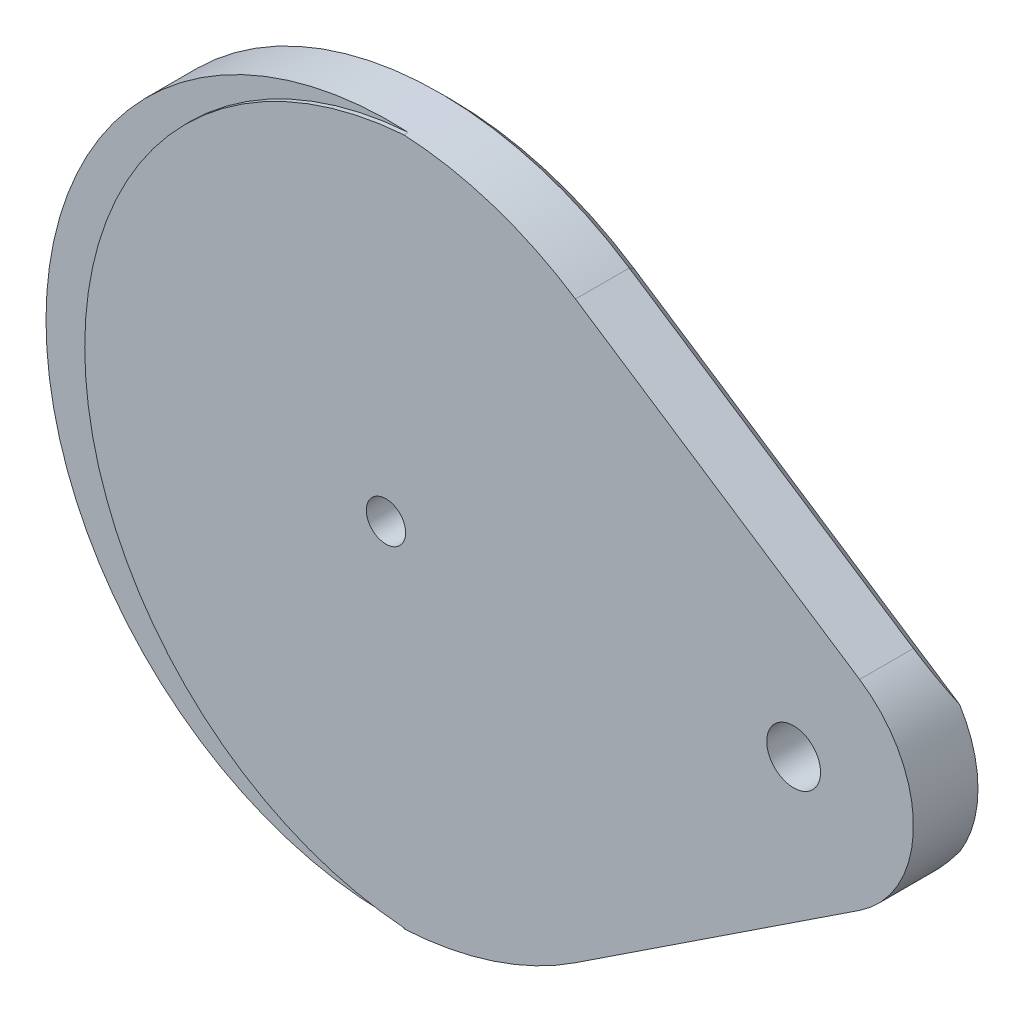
ISO-10303-21;
HEADER;
FILE_DESCRIPTION(('STEP AP214'),'2;1');
FILE_NAME('part.step','',(''),(''),'','','');
FILE_SCHEMA(('AUTOMOTIVE_DESIGN { 1 0 10303 214 1 1 1 1 }'));
ENDSEC;
DATA;
#1=APPLICATION_CONTEXT('core data for automotive mechanical design processes');
#2=APPLICATION_PROTOCOL_DEFINITION('international standard','automotive_design',2000,#1);
#3=PRODUCT_CONTEXT('',#1,'mechanical');
#4=PRODUCT('Part','Part','',(#3));
#5=PRODUCT_RELATED_PRODUCT_CATEGORY('part','',(#4));
#6=PRODUCT_DEFINITION_FORMATION('','',#4);
#7=PRODUCT_DEFINITION_CONTEXT('part definition',#1,'design');
#8=PRODUCT_DEFINITION('design','',#6,#7);
#9=PRODUCT_DEFINITION_SHAPE('','',#8);
#10=(LENGTH_UNIT() NAMED_UNIT(*) SI_UNIT(.MILLI.,.METRE.));
#11=(NAMED_UNIT(*) PLANE_ANGLE_UNIT() SI_UNIT($,.RADIAN.));
#12=(NAMED_UNIT(*) SI_UNIT($,.STERADIAN.) SOLID_ANGLE_UNIT());
#13=UNCERTAINTY_MEASURE_WITH_UNIT(LENGTH_MEASURE(1.E-05),#10,'distance_accuracy_value','');
#14=(GEOMETRIC_REPRESENTATION_CONTEXT(3) GLOBAL_UNCERTAINTY_ASSIGNED_CONTEXT((#13)) GLOBAL_UNIT_ASSIGNED_CONTEXT((#10,
#11,#12)) REPRESENTATION_CONTEXT('',''));
#15=CARTESIAN_POINT('',(0.,0.,0.));
#16=DIRECTION('',(0.,0.,1.));
#17=DIRECTION('',(1.,0.,0.));
#18=AXIS2_PLACEMENT_3D('',#15,#16,#17);
#19=CARTESIAN_POINT('',(0.,0.,0.));
#20=DIRECTION('',(0.,0.,1.));
#21=DIRECTION('',(1.,0.,0.));
#22=AXIS2_PLACEMENT_3D('',#19,#20,#21);
#23=PLANE('',#22);
#24=CARTESIAN_POINT('',(0.,0.,0.));
#25=DIRECTION('',(0.,0.,1.));
#26=DIRECTION('',(1.,0.,0.));
#27=AXIS2_PLACEMENT_3D('',#24,#25,#26);
#28=CIRCLE('',#27,5.79896140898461);
#29=CARTESIAN_POINT('',(-5.79896140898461,0.,0.));
#30=VERTEX_POINT('',#29);
#31=EDGE_CURVE('E217',#30,#30,#28,.T.);
#32=ORIENTED_EDGE('',*,*,#31,.T.);
#33=EDGE_LOOP('',(#32));
#34=FACE_BOUND('',#33,.T.);
#35=DIRECTION('',(0.834795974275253,0.550559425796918,0.));
#36=VECTOR('',#35,1.);
#37=CARTESIAN_POINT('',(54.1888114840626,-82.1647937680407,0.));
#38=LINE('',#37,#36);
#39=CARTESIAN_POINT('',(54.1888114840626,-82.1647937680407,0.));
#40=VERTEX_POINT('',#39);
#41=CARTESIAN_POINT('',(150.262212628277,-18.8030644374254,0.));
#42=VERTEX_POINT('',#41);
#43=EDGE_CURVE('E175',#40,#42,#38,.T.);
#44=ORIENTED_EDGE('',*,*,#43,.F.);
#45=CARTESIAN_POINT('',(0.,0.,0.));
#46=DIRECTION('',(0.,0.,1.));
#47=DIRECTION('',(1.,0.,0.));
#48=AXIS2_PLACEMENT_3D('',#45,#46,#47);
#49=CIRCLE('',#48,98.4249999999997);
#50=CARTESIAN_POINT('',(54.1888114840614,82.1647937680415,0.));
#51=VERTEX_POINT('',#50);
#52=EDGE_CURVE('E169',#51,#40,#49,.T.);
#53=ORIENTED_EDGE('',*,*,#52,.F.);
#54=DIRECTION('',(0.834795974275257,-0.550559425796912,0.));
#55=VECTOR('',#54,1.);
#56=CARTESIAN_POINT('',(165.35578994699,8.84864261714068,0.));
#57=LINE('',#56,#55);
#58=CARTESIAN_POINT('',(150.262212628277,18.8030644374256,0.));
#59=VERTEX_POINT('',#58);
#60=EDGE_CURVE('E155',#51,#59,#57,.T.);
#61=ORIENTED_EDGE('',*,*,#60,.T.);
#62=CARTESIAN_POINT('',(120.3198,0.,0.));
#63=DIRECTION('',(0.,0.,1.));
#64=DIRECTION('',(1.,0.,0.));
#65=AXIS2_PLACEMENT_3D('',#62,#63,#64);
#66=CIRCLE('',#65,35.3568);
#67=EDGE_CURVE('E223',#42,#59,#66,.T.);
#68=ORIENTED_EDGE('',*,*,#67,.F.);
#69=EDGE_LOOP('',(#44,#53,#61,#68));
#70=FACE_BOUND('',#69,.T.);
#71=DIRECTION('',(0.,1.,0.));
#72=VECTOR('',#71,1.);
#73=CARTESIAN_POINT('',(123.4948,-22.225,0.));
#74=LINE('',#73,#72);
#75=CARTESIAN_POINT('',(123.4948,19.05,0.));
#76=VERTEX_POINT('',#75);
#77=CARTESIAN_POINT('',(123.4948,7.27483891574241,0.));
#78=VERTEX_POINT('',#77);
#79=EDGE_CURVE('E54',#76,#78,#74,.F.);
#80=ORIENTED_EDGE('',*,*,#79,.F.);
#81=CARTESIAN_POINT('',(120.3198,19.05,0.));
#82=DIRECTION('',(0.,0.,1.));
#83=DIRECTION('',(1.,0.,0.));
#84=AXIS2_PLACEMENT_3D('',#81,#82,#83);
#85=CIRCLE('',#84,3.175);
#86=CARTESIAN_POINT('',(117.1448,19.05,0.));
#87=VERTEX_POINT('',#86);
#88=EDGE_CURVE('E11',#76,#87,#85,.T.);
#89=ORIENTED_EDGE('',*,*,#88,.T.);
#90=DIRECTION('',(0.,1.,0.));
#91=VECTOR('',#90,1.);
#92=CARTESIAN_POINT('',(117.1448,-22.225,0.));
#93=LINE('',#92,#91);
#94=CARTESIAN_POINT('',(117.1448,7.27483891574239,0.));
#95=VERTEX_POINT('',#94);
#96=EDGE_CURVE('E144',#95,#87,#93,.T.);
#97=ORIENTED_EDGE('',*,*,#96,.F.);
#98=CARTESIAN_POINT('',(120.3198,0.,0.));
#99=DIRECTION('',(0.,0.,1.));
#100=DIRECTION('',(1.,0.,0.));
#101=AXIS2_PLACEMENT_3D('',#98,#99,#100);
#102=CIRCLE('',#101,7.93750000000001);
#103=CARTESIAN_POINT('',(117.1448,-7.27483891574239,0.));
#104=VERTEX_POINT('',#103);
#105=EDGE_CURVE('E213',#95,#104,#102,.T.);
#106=ORIENTED_EDGE('',*,*,#105,.T.);
#107=CARTESIAN_POINT('',(117.1448,-19.05,0.));
#108=VERTEX_POINT('',#107);
#109=EDGE_CURVE('E46',#108,#104,#93,.T.);
#110=ORIENTED_EDGE('',*,*,#109,.F.);
#111=CARTESIAN_POINT('',(120.3198,-19.05,0.));
#112=DIRECTION('',(0.,0.,1.));
#113=DIRECTION('',(1.,0.,0.));
#114=AXIS2_PLACEMENT_3D('',#111,#112,#113);
#115=CIRCLE('',#114,3.175);
#116=CARTESIAN_POINT('',(123.4948,-19.05,0.));
#117=VERTEX_POINT('',#116);
#118=EDGE_CURVE('E39',#108,#117,#115,.T.);
#119=ORIENTED_EDGE('',*,*,#118,.T.);
#120=CARTESIAN_POINT('',(123.4948,-7.27483891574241,0.));
#121=VERTEX_POINT('',#120);
#122=EDGE_CURVE('E152',#121,#117,#74,.F.);
#123=ORIENTED_EDGE('',*,*,#122,.F.);
#124=EDGE_CURVE('E150',#121,#78,#102,.T.);
#125=ORIENTED_EDGE('',*,*,#124,.T.);
#126=EDGE_LOOP('',(#80,#89,#97,#106,#110,#119,#123,#125));
#127=FACE_BOUND('',#126,.T.);
#128=ADVANCED_FACE('F31',(#34,#70,#127),#23,.F.);
#129=CARTESIAN_POINT('',(120.3198,0.,19.05));
#130=DIRECTION('',(0.,0.,-1.));
#131=DIRECTION('',(-1.,0.,0.));
#132=AXIS2_PLACEMENT_3D('',#129,#130,#131);
#133=CYLINDRICAL_SURFACE('',#132,7.93750000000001);
#134=CARTESIAN_POINT('',(120.3198,0.,19.05));
#135=DIRECTION('',(0.,0.,1.));
#136=DIRECTION('',(1.,0.,0.));
#137=AXIS2_PLACEMENT_3D('',#134,#135,#136);
#138=CIRCLE('',#137,7.93750000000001);
#139=CARTESIAN_POINT('',(128.2573,0.,19.05));
#140=VERTEX_POINT('',#139);
#141=EDGE_CURVE('E214',#140,#140,#138,.T.);
#142=ORIENTED_EDGE('',*,*,#141,.T.);
#143=EDGE_LOOP('',(#142));
#144=FACE_BOUND('',#143,.T.);
#145=ORIENTED_EDGE('',*,*,#124,.F.);
#146=CARTESIAN_POINT('',(123.4948,-7.27483891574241,0.));
#147=CARTESIAN_POINT('',(123.494812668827,-7.27482137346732,0.0854167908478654));
#148=CARTESIAN_POINT('',(123.491353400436,-7.27634285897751,0.170823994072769));
#149=CARTESIAN_POINT('',(123.477590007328,-7.28233280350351,0.340949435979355));
#150=CARTESIAN_POINT('',(123.467288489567,-7.28680014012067,0.425667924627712));
#151=CARTESIAN_POINT('',(123.439993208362,-7.29852780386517,0.593481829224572));
#152=CARTESIAN_POINT('',(123.423025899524,-7.30577708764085,0.676582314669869));
#153=CARTESIAN_POINT('',(123.382589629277,-7.32282084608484,0.840899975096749));
#154=CARTESIAN_POINT('',(123.359120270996,-7.33261547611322,0.922117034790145));
#155=CARTESIAN_POINT('',(123.279328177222,-7.36535374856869,1.16194816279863));
#156=CARTESIAN_POINT('',(123.213566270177,-7.39167700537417,1.31707609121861));
#157=CARTESIAN_POINT('',(123.059002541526,-7.45033388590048,1.61416298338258));
#158=CARTESIAN_POINT('',(122.97017881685,-7.48267321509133,1.75610925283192));
#159=CARTESIAN_POINT('',(122.766642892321,-7.55175336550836,2.03082905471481));
#160=CARTESIAN_POINT('',(122.65083600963,-7.58863489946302,2.16275795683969));
#161=CARTESIAN_POINT('',(122.398943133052,-7.66147804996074,2.40592018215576));
#162=CARTESIAN_POINT('',(122.262852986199,-7.6974394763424,2.51714925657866));
#163=CARTESIAN_POINT('',(121.967634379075,-7.76610424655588,2.72003265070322));
#164=CARTESIAN_POINT('',(121.807808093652,-7.79862271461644,2.81073988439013));
#165=CARTESIAN_POINT('',(121.473633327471,-7.85501261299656,2.96361496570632));
#166=CARTESIAN_POINT('',(121.299290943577,-7.87888765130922,3.02579472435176));
#167=CARTESIAN_POINT('',(120.949985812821,-7.91429574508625,3.11680415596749));
#168=CARTESIAN_POINT('',(120.775461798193,-7.92637039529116,3.14710278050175));
#169=CARTESIAN_POINT('',(120.423413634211,-7.93877492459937,3.17822021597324));
#170=CARTESIAN_POINT('',(120.245890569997,-7.93910896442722,3.17904947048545));
#171=CARTESIAN_POINT('',(119.90350451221,-7.9283236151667,3.15200847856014));
#172=CARTESIAN_POINT('',(119.738490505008,-7.91784651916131,3.12574768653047));
#173=CARTESIAN_POINT('',(119.415441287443,-7.88748217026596,3.04801048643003));
#174=CARTESIAN_POINT('',(119.257406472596,-7.86759438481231,2.99653265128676));
#175=CARTESIAN_POINT('',(118.949950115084,-7.81997467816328,2.86918968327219));
#176=CARTESIAN_POINT('',(118.800694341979,-7.7921290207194,2.7929685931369));
#177=CARTESIAN_POINT('',(118.51670579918,-7.73135683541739,2.61863820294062));
#178=CARTESIAN_POINT('',(118.381978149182,-7.69842852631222,2.52052122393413));
#179=CARTESIAN_POINT('',(118.121487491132,-7.62828318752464,2.29767442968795));
#180=CARTESIAN_POINT('',(117.996891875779,-7.59092651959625,2.17162128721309));
#181=CARTESIAN_POINT('',(117.770119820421,-7.51779639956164,1.90028038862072));
#182=CARTESIAN_POINT('',(117.667953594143,-7.48202367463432,1.75498391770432));
#183=CARTESIAN_POINT('',(117.486203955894,-7.41514238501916,1.44383497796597));
#184=CARTESIAN_POINT('',(117.407354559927,-7.3841975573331,1.27751148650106));
#185=CARTESIAN_POINT('',(117.311344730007,-7.34535742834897,1.01897061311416));
#186=CARTESIAN_POINT('',(117.28305640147,-7.33367552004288,0.931303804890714));
#187=CARTESIAN_POINT('',(117.234141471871,-7.31322917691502,0.753538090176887));
#188=CARTESIAN_POINT('',(117.213511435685,-7.3044634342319,0.66344029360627));
#189=CARTESIAN_POINT('',(117.179569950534,-7.28994070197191,0.478275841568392));
#190=CARTESIAN_POINT('',(117.166547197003,-7.28430276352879,0.38314681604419));
#191=CARTESIAN_POINT('',(117.149154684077,-7.27673901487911,0.192016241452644));
#192=CARTESIAN_POINT('',(117.144779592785,-7.27481091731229,0.096015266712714));
#193=CARTESIAN_POINT('',(117.1448,-7.27483891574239,0.));
#194=B_SPLINE_CURVE_WITH_KNOTS('',3,(#146,#147,#148,#149,#150,#151,#152,#153,#154,#155,#156,
#157,#158,#159,#160,#161,#162,#163,#164,#165,#166,#167,#168,#169,#170,#171,#172,#173,#174,#175,
#176,#177,#178,#179,#180,#181,#182,#183,#184,#185,#186,#187,#188,#189,#190,#191,#192,#193),
.UNSPECIFIED.,.F.,.F.,(4,2,2,2,2,2,2,2,2,2,2,2,2,2,2,2,2,2,2,2,2,2,2,4),(0.,0.256150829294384,
0.512204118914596,0.767251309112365,1.02231407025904,1.53143426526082,2.0410397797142,
2.57679901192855,3.11266809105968,3.66971038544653,4.22651988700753,4.75637028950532,
5.28603291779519,5.78594402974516,6.28588343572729,6.79335980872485,7.30101443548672,
7.84196226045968,8.3831559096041,8.93991483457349,9.21815697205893,9.49627415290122,
9.78435582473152,10.072259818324),.UNSPECIFIED.);
#195=EDGE_CURVE('E266',#121,#104,#194,.T.);
#196=ORIENTED_EDGE('',*,*,#195,.T.);
#197=ORIENTED_EDGE('',*,*,#105,.F.);
#198=CARTESIAN_POINT('',(117.1448,7.27483891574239,0.));
#199=CARTESIAN_POINT('',(117.144787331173,7.27482137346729,0.0854167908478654));
#200=CARTESIAN_POINT('',(117.148246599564,7.27634285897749,0.17082399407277));
#201=CARTESIAN_POINT('',(117.162009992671,7.28233280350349,0.340949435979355));
#202=CARTESIAN_POINT('',(117.172311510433,7.28680014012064,0.425667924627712));
#203=CARTESIAN_POINT('',(117.199606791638,7.29852780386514,0.593481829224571));
#204=CARTESIAN_POINT('',(117.216574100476,7.30577708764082,0.676582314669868));
#205=CARTESIAN_POINT('',(117.257010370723,7.32282084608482,0.840899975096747));
#206=CARTESIAN_POINT('',(117.280479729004,7.3326154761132,0.922117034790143));
#207=CARTESIAN_POINT('',(117.360271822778,7.36535374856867,1.16194816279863));
#208=CARTESIAN_POINT('',(117.426033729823,7.39167700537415,1.31707609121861));
#209=CARTESIAN_POINT('',(117.580597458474,7.45033388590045,1.61416298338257));
#210=CARTESIAN_POINT('',(117.66942118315,7.48267321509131,1.75610925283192));
#211=CARTESIAN_POINT('',(117.872957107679,7.55175336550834,2.03082905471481));
#212=CARTESIAN_POINT('',(117.98876399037,7.588634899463,2.16275795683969));
#213=CARTESIAN_POINT('',(118.240656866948,7.66147804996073,2.40592018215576));
#214=CARTESIAN_POINT('',(118.376747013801,7.69743947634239,2.51714925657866));
#215=CARTESIAN_POINT('',(118.671965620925,7.76610424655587,2.72003265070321));
#216=CARTESIAN_POINT('',(118.831791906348,7.79862271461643,2.81073988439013));
#217=CARTESIAN_POINT('',(119.165966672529,7.85501261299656,2.96361496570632));
#218=CARTESIAN_POINT('',(119.340309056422,7.87888765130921,3.02579472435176));
#219=CARTESIAN_POINT('',(119.689614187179,7.91429574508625,3.11680415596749));
#220=CARTESIAN_POINT('',(119.864138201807,7.92637039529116,3.14710278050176));
#221=CARTESIAN_POINT('',(120.216186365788,7.93877492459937,3.17822021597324));
#222=CARTESIAN_POINT('',(120.393709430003,7.93910896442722,3.17904947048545));
#223=CARTESIAN_POINT('',(120.73609548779,7.9283236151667,3.15200847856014));
#224=CARTESIAN_POINT('',(120.901109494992,7.91784651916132,3.12574768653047));
#225=CARTESIAN_POINT('',(121.224158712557,7.88748217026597,3.04801048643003));
#226=CARTESIAN_POINT('',(121.382193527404,7.86759438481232,2.99653265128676));
#227=CARTESIAN_POINT('',(121.689649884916,7.81997467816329,2.86918968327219));
#228=CARTESIAN_POINT('',(121.838905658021,7.79212902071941,2.79296859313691));
#229=CARTESIAN_POINT('',(122.12289420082,7.73135683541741,2.61863820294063));
#230=CARTESIAN_POINT('',(122.257621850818,7.69842852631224,2.52052122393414));
#231=CARTESIAN_POINT('',(122.518112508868,7.62828318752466,2.29767442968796));
#232=CARTESIAN_POINT('',(122.642708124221,7.59092651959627,2.1716212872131));
#233=CARTESIAN_POINT('',(122.869480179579,7.51779639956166,1.90028038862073));
#234=CARTESIAN_POINT('',(122.971646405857,7.48202367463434,1.75498391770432));
#235=CARTESIAN_POINT('',(123.153396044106,7.41514238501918,1.44383497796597));
#236=CARTESIAN_POINT('',(123.232245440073,7.38419755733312,1.27751148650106));
#237=CARTESIAN_POINT('',(123.328255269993,7.34535742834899,1.01897061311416));
#238=CARTESIAN_POINT('',(123.35654359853,7.3336755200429,0.931303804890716));
#239=CARTESIAN_POINT('',(123.405458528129,7.31322917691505,0.753538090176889));
#240=CARTESIAN_POINT('',(123.426088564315,7.30446343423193,0.663440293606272));
#241=CARTESIAN_POINT('',(123.460030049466,7.28994070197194,0.478275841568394));
#242=CARTESIAN_POINT('',(123.473052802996,7.28430276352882,0.383146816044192));
#243=CARTESIAN_POINT('',(123.490445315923,7.27673901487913,0.192016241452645));
#244=CARTESIAN_POINT('',(123.494820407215,7.27481091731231,0.0960152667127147));
#245=CARTESIAN_POINT('',(123.4948,7.27483891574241,0.));
#246=B_SPLINE_CURVE_WITH_KNOTS('',3,(#198,#199,#200,#201,#202,#203,#204,#205,#206,#207,#208,
#209,#210,#211,#212,#213,#214,#215,#216,#217,#218,#219,#220,#221,#222,#223,#224,#225,#226,#227,
#228,#229,#230,#231,#232,#233,#234,#235,#236,#237,#238,#239,#240,#241,#242,#243,#244,#245),
.UNSPECIFIED.,.F.,.F.,(4,2,2,2,2,2,2,2,2,2,2,2,2,2,2,2,2,2,2,2,2,2,2,4),(0.,0.256150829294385,
0.512204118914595,0.767251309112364,1.02231407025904,1.53143426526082,2.04103977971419,
2.57679901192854,3.11266809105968,3.66971038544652,4.22651988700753,4.75637028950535,
5.28603291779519,5.78594402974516,6.2858834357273,6.79335980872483,7.30101443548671,
7.84196226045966,8.38315590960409,8.93991483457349,9.21815697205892,9.49627415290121,
9.78435582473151,10.072259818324),.UNSPECIFIED.);
#247=EDGE_CURVE('E259',#95,#78,#246,.T.);
#248=ORIENTED_EDGE('',*,*,#247,.T.);
#249=EDGE_LOOP('',(#145,#196,#197,#248));
#250=FACE_BOUND('',#249,.T.);
#251=ADVANCED_FACE('F270',(#144,#250),#133,.F.);
#252=CARTESIAN_POINT('',(120.3198,0.,19.05));
#253=DIRECTION('',(0.,0.,-1.));
#254=DIRECTION('',(-1.,0.,0.));
#255=AXIS2_PLACEMENT_3D('',#252,#253,#254);
#256=CYLINDRICAL_SURFACE('',#255,35.3568);
#257=CARTESIAN_POINT('',(120.3198,0.,-32.1817999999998));
#258=DIRECTION('',(0.389304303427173,-0.590289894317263,-0.707106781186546));
#259=DIRECTION('',(-0.389304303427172,0.590289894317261,-0.707106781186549));
#260=AXIS2_PLACEMENT_3D('',#257,#258,#259);
#261=ELLIPSE('',#260,50.0020660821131,35.3568);
#262=CARTESIAN_POINT('',(139.785819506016,-29.515714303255,3.17500000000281));
#263=VERTEX_POINT('',#262);
#264=EDGE_CURVE('E257',#42,#263,#261,.T.);
#265=ORIENTED_EDGE('',*,*,#264,.F.);
#266=ORIENTED_EDGE('',*,*,#67,.T.);
#267=CARTESIAN_POINT('',(120.3198,0.,-32.1817999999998));
#268=DIRECTION('',(-0.389304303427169,-0.590289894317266,0.707106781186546));
#269=DIRECTION('',(-0.389304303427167,-0.590289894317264,-0.707106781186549));
#270=AXIS2_PLACEMENT_3D('',#267,#268,#269);
#271=ELLIPSE('',#270,50.0020660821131,35.3568);
#272=CARTESIAN_POINT('',(139.785819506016,29.515714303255,3.17500000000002));
#273=VERTEX_POINT('',#272);
#274=EDGE_CURVE('E181',#59,#273,#271,.T.);
#275=ORIENTED_EDGE('',*,*,#274,.T.);
#276=DIRECTION('',(0.,0.,-1.));
#277=VECTOR('',#276,1.);
#278=CARTESIAN_POINT('',(139.785819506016,29.5157143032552,19.05));
#279=LINE('',#278,#277);
#280=CARTESIAN_POINT('',(139.785819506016,29.5157143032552,19.05));
#281=VERTEX_POINT('',#280);
#282=EDGE_CURVE('E241',#281,#273,#279,.T.);
#283=ORIENTED_EDGE('',*,*,#282,.F.);
#284=CARTESIAN_POINT('',(120.3198,0.,19.05));
#285=DIRECTION('',(0.,0.,1.));
#286=DIRECTION('',(1.,0.,0.));
#287=AXIS2_PLACEMENT_3D('',#284,#285,#286);
#288=CIRCLE('',#287,35.3568);
#289=CARTESIAN_POINT('',(139.785819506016,-29.5157143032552,19.05));
#290=VERTEX_POINT('',#289);
#291=EDGE_CURVE('E232',#290,#281,#288,.T.);
#292=ORIENTED_EDGE('',*,*,#291,.F.);
#293=DIRECTION('',(0.,0.,-1.));
#294=VECTOR('',#293,1.);
#295=CARTESIAN_POINT('',(139.785819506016,-29.5157143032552,19.05));
#296=LINE('',#295,#294);
#297=EDGE_CURVE('E244',#290,#263,#296,.T.);
#298=ORIENTED_EDGE('',*,*,#297,.T.);
#299=EDGE_LOOP('',(#265,#266,#275,#283,#292,#298));
#300=FACE_BOUND('',#299,.T.);
#301=ADVANCED_FACE('F326',(#300),#256,.T.);
#302=CARTESIAN_POINT('',(0.,0.,19.05));
#303=DIRECTION('',(0.,0.,1.));
#304=DIRECTION('',(1.,0.,0.));
#305=AXIS2_PLACEMENT_3D('',#302,#303,#304);
#306=PLANE('',#305);
#307=DIRECTION('',(0.,1.,0.));
#308=VECTOR('',#307,1.);
#309=CARTESIAN_POINT('',(5.27332086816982,101.460631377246,19.05));
#310=LINE('',#309,#308);
#311=CARTESIAN_POINT('',(5.27332086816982,101.460631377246,19.05));
#312=VERTEX_POINT('',#311);
#313=CARTESIAN_POINT('',(5.27332086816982,101.463057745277,19.05));
#314=VERTEX_POINT('',#313);
#315=EDGE_CURVE('E193',#312,#314,#310,.T.);
#316=ORIENTED_EDGE('',*,*,#315,.F.);
#317=CARTESIAN_POINT('',(12.7,0.132343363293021,19.05));
#318=DIRECTION('',(0.,0.,1.));
#319=DIRECTION('',(1.,0.,0.));
#320=AXIS2_PLACEMENT_3D('',#317,#318,#319);
#321=CIRCLE('',#320,101.600086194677);
#322=CARTESIAN_POINT('',(5.25951137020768,-101.194931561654,19.05));
#323=VERTEX_POINT('',#322);
#324=EDGE_CURVE('E190',#312,#323,#321,.T.);
#325=ORIENTED_EDGE('',*,*,#324,.T.);
#326=DIRECTION('',(0.0519040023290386,-0.998652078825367,0.));
#327=VECTOR('',#326,1.);
#328=CARTESIAN_POINT('',(5.25951137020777,-101.194931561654,19.05));
#329=LINE('',#328,#327);
#330=CARTESIAN_POINT('',(5.27332086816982,-101.460631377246,19.05));
#331=VERTEX_POINT('',#330);
#332=EDGE_CURVE('E187',#323,#331,#329,.T.);
#333=ORIENTED_EDGE('',*,*,#332,.T.);
#334=DIRECTION('',(0.,-1.,0.));
#335=VECTOR('',#334,1.);
#336=CARTESIAN_POINT('',(5.27332086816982,-101.460631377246,19.05));
#337=LINE('',#336,#335);
#338=CARTESIAN_POINT('',(5.27332086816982,-101.463057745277,19.05));
#339=VERTEX_POINT('',#338);
#340=EDGE_CURVE('E184',#331,#339,#337,.T.);
#341=ORIENTED_EDGE('',*,*,#340,.T.);
#342=CARTESIAN_POINT('',(0.,0.,19.05));
#343=DIRECTION('',(0.,0.,1.));
#344=DIRECTION('',(1.,0.,0.));
#345=AXIS2_PLACEMENT_3D('',#342,#343,#344);
#346=CIRCLE('',#345,101.6);
#347=CARTESIAN_POINT('',(55.9368376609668,-84.8152709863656,19.05));
#348=VERTEX_POINT('',#347);
#349=EDGE_CURVE('E225',#339,#348,#346,.T.);
#350=ORIENTED_EDGE('',*,*,#349,.T.);
#351=DIRECTION('',(0.834795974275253,0.550559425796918,0.));
#352=VECTOR('',#351,1.);
#353=CARTESIAN_POINT('',(55.9368376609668,-84.8152709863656,19.05));
#354=LINE('',#353,#352);
#355=EDGE_CURVE('E229',#348,#290,#354,.T.);
#356=ORIENTED_EDGE('',*,*,#355,.T.);
#357=ORIENTED_EDGE('',*,*,#291,.T.);
#358=DIRECTION('',(0.834795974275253,-0.550559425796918,0.));
#359=VECTOR('',#358,1.);
#360=CARTESIAN_POINT('',(55.9368376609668,84.8152709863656,19.05));
#361=LINE('',#360,#359);
#362=CARTESIAN_POINT('',(55.9368376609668,84.8152709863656,19.05));
#363=VERTEX_POINT('',#362);
#364=EDGE_CURVE('E235',#363,#281,#361,.T.);
#365=ORIENTED_EDGE('',*,*,#364,.F.);
#366=EDGE_CURVE('E226',#363,#314,#346,.T.);
#367=ORIENTED_EDGE('',*,*,#366,.T.);
#368=EDGE_LOOP('',(#316,#325,#333,#341,#350,#356,#357,#365,#367));
#369=FACE_BOUND('',#368,.T.);
#370=CARTESIAN_POINT('',(0.,0.,19.05));
#371=DIRECTION('',(0.,0.,1.));
#372=DIRECTION('',(1.,0.,0.));
#373=AXIS2_PLACEMENT_3D('',#370,#371,#372);
#374=CIRCLE('',#373,5.79896140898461);
#375=CARTESIAN_POINT('',(-5.79896140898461,0.,19.05));
#376=VERTEX_POINT('',#375);
#377=EDGE_CURVE('E220',#376,#376,#374,.T.);
#378=ORIENTED_EDGE('',*,*,#377,.F.);
#379=EDGE_LOOP('',(#378));
#380=FACE_BOUND('',#379,.T.);
#381=ORIENTED_EDGE('',*,*,#141,.F.);
#382=EDGE_LOOP('',(#381));
#383=FACE_BOUND('',#382,.T.);
#384=ADVANCED_FACE('F329',(#369,#380,#383),#306,.T.);
#385=CARTESIAN_POINT('',(0.,0.,19.05));
#386=DIRECTION('',(0.,0.,-1.));
#387=DIRECTION('',(-1.,0.,0.));
#388=AXIS2_PLACEMENT_3D('',#385,#386,#387);
#389=CYLINDRICAL_SURFACE('',#388,101.6);
#390=DIRECTION('',(0.,0.,-1.));
#391=VECTOR('',#390,1.);
#392=CARTESIAN_POINT('',(55.9368376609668,84.8152709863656,19.05));
#393=LINE('',#392,#391);
#394=CARTESIAN_POINT('',(55.9368376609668,84.8152709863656,3.17500000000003));
#395=VERTEX_POINT('',#394);
#396=EDGE_CURVE('E238',#363,#395,#393,.T.);
#397=ORIENTED_EDGE('',*,*,#396,.T.);
#398=CARTESIAN_POINT('',(0.,0.,3.17500000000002));
#399=DIRECTION('',(0.,0.,1.));
#400=DIRECTION('',(1.,0.,0.));
#401=AXIS2_PLACEMENT_3D('',#398,#399,#400);
#402=CIRCLE('',#401,101.6);
#403=CARTESIAN_POINT('',(55.9368376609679,-84.8152709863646,3.17500000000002));
#404=VERTEX_POINT('',#403);
#405=EDGE_CURVE('E172',#395,#404,#402,.T.);
#406=ORIENTED_EDGE('',*,*,#405,.T.);
#407=DIRECTION('',(0.,0.,-1.));
#408=VECTOR('',#407,1.);
#409=CARTESIAN_POINT('',(55.9368376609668,-84.8152709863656,19.05));
#410=LINE('',#409,#408);
#411=EDGE_CURVE('E247',#348,#404,#410,.T.);
#412=ORIENTED_EDGE('',*,*,#411,.F.);
#413=ORIENTED_EDGE('',*,*,#349,.F.);
#414=DIRECTION('',(0.,0.,-1.));
#415=VECTOR('',#414,1.);
#416=CARTESIAN_POINT('',(5.27332086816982,-101.463057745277,19.05));
#417=LINE('',#416,#415);
#418=CARTESIAN_POINT('',(5.27332086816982,-101.463057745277,17.78));
#419=VERTEX_POINT('',#418);
#420=EDGE_CURVE('E252',#419,#339,#417,.F.);
#421=ORIENTED_EDGE('',*,*,#420,.F.);
#422=CARTESIAN_POINT('',(0.,0.,17.78));
#423=DIRECTION('',(0.,0.,1.));
#424=DIRECTION('',(1.,0.,0.));
#425=AXIS2_PLACEMENT_3D('',#422,#423,#424);
#426=CIRCLE('',#425,101.6);
#427=CARTESIAN_POINT('',(5.27332086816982,101.463057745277,17.78));
#428=VERTEX_POINT('',#427);
#429=EDGE_CURVE('E250',#428,#419,#426,.T.);
#430=ORIENTED_EDGE('',*,*,#429,.F.);
#431=DIRECTION('',(0.,0.,-1.));
#432=VECTOR('',#431,1.);
#433=CARTESIAN_POINT('',(5.27332086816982,101.463057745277,19.05));
#434=LINE('',#433,#432);
#435=EDGE_CURVE('E254',#428,#314,#434,.F.);
#436=ORIENTED_EDGE('',*,*,#435,.T.);
#437=ORIENTED_EDGE('',*,*,#366,.F.);
#438=EDGE_LOOP('',(#397,#406,#412,#413,#421,#430,#436,#437));
#439=FACE_BOUND('',#438,.T.);
#440=ADVANCED_FACE('F332',(#439),#389,.T.);
#441=CARTESIAN_POINT('',(55.9368376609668,-84.8152709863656,19.05));
#442=DIRECTION('',(-0.550559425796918,0.834795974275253,0.));
#443=DIRECTION('',(-0.834795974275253,-0.550559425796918,0.));
#444=AXIS2_PLACEMENT_3D('',#441,#442,#443);
#445=PLANE('',#444);
#446=ORIENTED_EDGE('',*,*,#411,.T.);
#447=DIRECTION('',(0.834795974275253,0.550559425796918,0.));
#448=VECTOR('',#447,1.);
#449=CARTESIAN_POINT('',(55.9368376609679,-84.8152709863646,3.17500000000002));
#450=LINE('',#449,#448);
#451=EDGE_CURVE('E178',#404,#263,#450,.T.);
#452=ORIENTED_EDGE('',*,*,#451,.T.);
#453=ORIENTED_EDGE('',*,*,#297,.F.);
#454=ORIENTED_EDGE('',*,*,#355,.F.);
#455=EDGE_LOOP('',(#446,#452,#453,#454));
#456=FACE_BOUND('',#455,.T.);
#457=ADVANCED_FACE('F33',(#456),#445,.F.);
#458=CARTESIAN_POINT('',(55.9368376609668,84.8152709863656,19.05));
#459=DIRECTION('',(0.550559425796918,0.834795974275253,0.));
#460=DIRECTION('',(-0.834795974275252,0.550559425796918,0.));
#461=AXIS2_PLACEMENT_3D('',#458,#459,#460);
#462=PLANE('',#461);
#463=DIRECTION('',(0.834795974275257,-0.550559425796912,0.));
#464=VECTOR('',#463,1.);
#465=CARTESIAN_POINT('',(167.103816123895,11.4991198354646,3.17500000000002));
#466=LINE('',#465,#464);
#467=EDGE_CURVE('E158',#395,#273,#466,.T.);
#468=ORIENTED_EDGE('',*,*,#467,.F.);
#469=ORIENTED_EDGE('',*,*,#396,.F.);
#470=ORIENTED_EDGE('',*,*,#364,.T.);
#471=ORIENTED_EDGE('',*,*,#282,.T.);
#472=EDGE_LOOP('',(#468,#469,#470,#471));
#473=FACE_BOUND('',#472,.T.);
#474=ADVANCED_FACE('F317',(#473),#462,.T.);
#475=CARTESIAN_POINT('',(0.,0.,19.05));
#476=DIRECTION('',(0.,0.,-1.));
#477=DIRECTION('',(-1.,0.,0.));
#478=AXIS2_PLACEMENT_3D('',#475,#476,#477);
#479=CYLINDRICAL_SURFACE('',#478,5.79896140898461);
#480=CARTESIAN_POINT('',(-5.79896140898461,0.,19.05));
#481=CARTESIAN_POINT('',(-5.79896140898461,0.,18.8515625));
#482=CARTESIAN_POINT('',(-5.79896140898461,0.,18.653125));
#483=CARTESIAN_POINT('',(-5.79896140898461,0.,18.25625));
#484=CARTESIAN_POINT('',(-5.79896140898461,0.,18.0578125));
#485=CARTESIAN_POINT('',(-5.79896140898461,0.,17.6609375));
#486=CARTESIAN_POINT('',(-5.79896140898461,0.,17.4625));
#487=CARTESIAN_POINT('',(-5.79896140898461,0.,17.065625));
#488=CARTESIAN_POINT('',(-5.79896140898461,0.,16.8671875));
#489=CARTESIAN_POINT('',(-5.79896140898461,0.,16.4703125));
#490=CARTESIAN_POINT('',(-5.79896140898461,0.,16.271875));
#491=CARTESIAN_POINT('',(-5.79896140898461,0.,15.875));
#492=CARTESIAN_POINT('',(-5.79896140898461,0.,15.6765625));
#493=CARTESIAN_POINT('',(-5.79896140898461,0.,15.2796875));
#494=CARTESIAN_POINT('',(-5.79896140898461,0.,15.08125));
#495=CARTESIAN_POINT('',(-5.79896140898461,0.,14.684375));
#496=CARTESIAN_POINT('',(-5.79896140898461,0.,14.4859375));
#497=CARTESIAN_POINT('',(-5.79896140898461,0.,14.0890625));
#498=CARTESIAN_POINT('',(-5.79896140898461,0.,13.890625));
#499=CARTESIAN_POINT('',(-5.79896140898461,0.,13.49375));
#500=CARTESIAN_POINT('',(-5.79896140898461,0.,13.2953125));
#501=CARTESIAN_POINT('',(-5.79896140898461,0.,12.8984375));
#502=CARTESIAN_POINT('',(-5.79896140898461,0.,12.7));
#503=CARTESIAN_POINT('',(-5.79896140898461,0.,12.303125));
#504=CARTESIAN_POINT('',(-5.79896140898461,0.,12.1046875));
#505=CARTESIAN_POINT('',(-5.79896140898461,0.,11.7078125));
#506=CARTESIAN_POINT('',(-5.79896140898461,0.,11.509375));
#507=CARTESIAN_POINT('',(-5.79896140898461,0.,11.1125));
#508=CARTESIAN_POINT('',(-5.79896140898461,0.,10.9140625));
#509=CARTESIAN_POINT('',(-5.79896140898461,0.,10.5171875));
#510=CARTESIAN_POINT('',(-5.79896140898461,0.,10.31875));
#511=CARTESIAN_POINT('',(-5.79896140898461,0.,9.921875));
#512=CARTESIAN_POINT('',(-5.79896140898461,0.,9.7234375));
#513=CARTESIAN_POINT('',(-5.79896140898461,0.,9.3265625));
#514=CARTESIAN_POINT('',(-5.79896140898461,0.,9.128125));
#515=CARTESIAN_POINT('',(-5.79896140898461,0.,8.73125));
#516=CARTESIAN_POINT('',(-5.79896140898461,0.,8.5328125));
#517=CARTESIAN_POINT('',(-5.79896140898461,0.,8.1359375));
#518=CARTESIAN_POINT('',(-5.79896140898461,0.,7.9375));
#519=CARTESIAN_POINT('',(-5.79896140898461,0.,7.540625));
#520=CARTESIAN_POINT('',(-5.79896140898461,0.,7.3421875));
#521=CARTESIAN_POINT('',(-5.79896140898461,0.,6.9453125));
#522=CARTESIAN_POINT('',(-5.79896140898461,0.,6.746875));
#523=CARTESIAN_POINT('',(-5.79896140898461,0.,6.35));
#524=CARTESIAN_POINT('',(-5.79896140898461,0.,6.1515625));
#525=CARTESIAN_POINT('',(-5.79896140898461,0.,5.7546875));
#526=CARTESIAN_POINT('',(-5.79896140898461,0.,5.55625));
#527=CARTESIAN_POINT('',(-5.79896140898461,0.,5.159375));
#528=CARTESIAN_POINT('',(-5.79896140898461,0.,4.9609375));
#529=CARTESIAN_POINT('',(-5.79896140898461,0.,4.5640625));
#530=CARTESIAN_POINT('',(-5.79896140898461,0.,4.365625));
#531=CARTESIAN_POINT('',(-5.79896140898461,0.,3.96875));
#532=CARTESIAN_POINT('',(-5.79896140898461,0.,3.7703125));
#533=CARTESIAN_POINT('',(-5.79896140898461,0.,3.3734375));
#534=CARTESIAN_POINT('',(-5.79896140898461,0.,3.175));
#535=CARTESIAN_POINT('',(-5.79896140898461,0.,2.778125));
#536=CARTESIAN_POINT('',(-5.79896140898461,0.,2.5796875));
#537=CARTESIAN_POINT('',(-5.79896140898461,0.,2.1828125));
#538=CARTESIAN_POINT('',(-5.79896140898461,0.,1.984375));
#539=CARTESIAN_POINT('',(-5.79896140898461,0.,1.5875));
#540=CARTESIAN_POINT('',(-5.79896140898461,0.,1.3890625));
#541=CARTESIAN_POINT('',(-5.79896140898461,0.,0.992187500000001));
#542=CARTESIAN_POINT('',(-5.79896140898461,0.,0.793750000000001));
#543=CARTESIAN_POINT('',(-5.79896140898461,0.,0.396875));
#544=CARTESIAN_POINT('',(-5.79896140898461,0.,0.1984375));
#545=CARTESIAN_POINT('',(-5.79896140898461,0.,0.));
#546=B_SPLINE_CURVE_WITH_KNOTS('',3,(#480,#481,#482,#483,#484,#485,#486,#487,#488,#489,#490,
#491,#492,#493,#494,#495,#496,#497,#498,#499,#500,#501,#502,#503,#504,#505,#506,#507,#508,#509,
#510,#511,#512,#513,#514,#515,#516,#517,#518,#519,#520,#521,#522,#523,#524,#525,#526,#527,#528,
#529,#530,#531,#532,#533,#534,#535,#536,#537,#538,#539,#540,#541,#542,#543,#544,#545),
.UNSPECIFIED.,.F.,.F.,(4,2,2,2,2,2,2,2,2,2,2,2,2,2,2,2,2,2,2,2,2,2,2,2,2,2,2,2,2,2,2,2,4),(0.,
0.595312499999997,1.190625,1.7859375,2.38125,2.9765625,3.571875,4.1671875,4.7625,5.3578125,
5.953125,6.5484375,7.14375,7.7390625,8.334375,8.9296875,9.525,10.1203125,10.715625,11.3109375,
11.90625,12.5015625,13.096875,13.6921875,14.2875,14.8828125,15.478125,16.0734375,16.66875,
17.2640625,17.859375,18.4546875,19.05),.UNSPECIFIED.);
#547=EDGE_CURVE('BSEAM312',#376,#30,#546,.T.);
#548=ORIENTED_EDGE('',*,*,#377,.T.);
#549=ORIENTED_EDGE('',*,*,#31,.F.);
#550=ORIENTED_EDGE('',*,*,#547,.T.);
#551=ORIENTED_EDGE('',*,*,#547,.F.);
#552=EDGE_LOOP('',(#548,#550,#549,#551));
#553=FACE_BOUND('',#552,.T.);
#554=ADVANCED_FACE('F312',(#553),#479,.F.);
#555=CARTESIAN_POINT('',(5.27332086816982,101.460631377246,17.78));
#556=DIRECTION('',(1.,0.,0.));
#557=DIRECTION('',(0.,0.,-1.));
#558=AXIS2_PLACEMENT_3D('',#555,#556,#557);
#559=PLANE('',#558);
#560=DIRECTION('',(0.,1.,0.));
#561=VECTOR('',#560,1.);
#562=CARTESIAN_POINT('',(5.27332086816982,101.460631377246,17.78));
#563=LINE('',#562,#561);
#564=CARTESIAN_POINT('',(5.27332086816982,101.460631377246,17.78));
#565=VERTEX_POINT('',#564);
#566=EDGE_CURVE('E204',#565,#428,#563,.T.);
#567=ORIENTED_EDGE('',*,*,#566,.F.);
#568=DIRECTION('',(0.,0.,1.));
#569=VECTOR('',#568,1.);
#570=CARTESIAN_POINT('',(5.27332086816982,101.460631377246,17.78));
#571=LINE('',#570,#569);
#572=EDGE_CURVE('E210',#565,#312,#571,.T.);
#573=ORIENTED_EDGE('',*,*,#572,.T.);
#574=ORIENTED_EDGE('',*,*,#315,.T.);
#575=ORIENTED_EDGE('',*,*,#435,.F.);
#576=EDGE_LOOP('',(#567,#573,#574,#575));
#577=FACE_BOUND('',#576,.T.);
#578=ADVANCED_FACE('F304',(#577),#559,.F.);
#579=CARTESIAN_POINT('',(5.27332086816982,-101.460631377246,17.78));
#580=DIRECTION('',(-1.,0.,0.));
#581=DIRECTION('',(0.,0.,1.));
#582=AXIS2_PLACEMENT_3D('',#579,#580,#581);
#583=PLANE('',#582);
#584=ORIENTED_EDGE('',*,*,#420,.T.);
#585=ORIENTED_EDGE('',*,*,#340,.F.);
#586=DIRECTION('',(0.,0.,1.));
#587=VECTOR('',#586,1.);
#588=CARTESIAN_POINT('',(5.27332086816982,-101.460631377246,17.78));
#589=LINE('',#588,#587);
#590=CARTESIAN_POINT('',(5.27332086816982,-101.460631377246,17.78));
#591=VERTEX_POINT('',#590);
#592=EDGE_CURVE('E206',#591,#331,#589,.T.);
#593=ORIENTED_EDGE('',*,*,#592,.F.);
#594=DIRECTION('',(0.,-1.,0.));
#595=VECTOR('',#594,1.);
#596=CARTESIAN_POINT('',(5.27332086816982,-101.460631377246,17.78));
#597=LINE('',#596,#595);
#598=EDGE_CURVE('E195',#591,#419,#597,.T.);
#599=ORIENTED_EDGE('',*,*,#598,.T.);
#600=EDGE_LOOP('',(#584,#585,#593,#599));
#601=FACE_BOUND('',#600,.T.);
#602=ADVANCED_FACE('F300',(#601),#583,.T.);
#603=CARTESIAN_POINT('',(0.,0.,17.78));
#604=DIRECTION('',(0.,0.,1.));
#605=DIRECTION('',(1.,0.,0.));
#606=AXIS2_PLACEMENT_3D('',#603,#604,#605);
#607=PLANE('',#606);
#608=ORIENTED_EDGE('',*,*,#429,.T.);
#609=ORIENTED_EDGE('',*,*,#598,.F.);
#610=DIRECTION('',(0.0519040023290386,-0.998652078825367,0.));
#611=VECTOR('',#610,1.);
#612=CARTESIAN_POINT('',(5.25951137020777,-101.194931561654,17.78));
#613=LINE('',#612,#611);
#614=CARTESIAN_POINT('',(5.25951137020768,-101.194931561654,17.78));
#615=VERTEX_POINT('',#614);
#616=EDGE_CURVE('E198',#615,#591,#613,.T.);
#617=ORIENTED_EDGE('',*,*,#616,.F.);
#618=CARTESIAN_POINT('',(12.7,0.132343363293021,17.78));
#619=DIRECTION('',(0.,0.,1.));
#620=DIRECTION('',(1.,0.,0.));
#621=AXIS2_PLACEMENT_3D('',#618,#619,#620);
#622=CIRCLE('',#621,101.600086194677);
#623=EDGE_CURVE('E201',#565,#615,#622,.T.);
#624=ORIENTED_EDGE('',*,*,#623,.F.);
#625=ORIENTED_EDGE('',*,*,#566,.T.);
#626=EDGE_LOOP('',(#608,#609,#617,#624,#625));
#627=FACE_BOUND('',#626,.T.);
#628=ADVANCED_FACE('F296',(#627),#607,.T.);
#629=CARTESIAN_POINT('',(12.7,0.132343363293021,17.78));
#630=DIRECTION('',(0.,0.,1.));
#631=DIRECTION('',(1.,0.,0.));
#632=AXIS2_PLACEMENT_3D('',#629,#630,#631);
#633=CYLINDRICAL_SURFACE('',#632,101.600086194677);
#634=DIRECTION('',(0.,0.,1.));
#635=VECTOR('',#634,1.);
#636=CARTESIAN_POINT('',(5.25951137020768,-101.194931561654,17.78));
#637=LINE('',#636,#635);
#638=EDGE_CURVE('E208',#615,#323,#637,.T.);
#639=ORIENTED_EDGE('',*,*,#638,.T.);
#640=ORIENTED_EDGE('',*,*,#324,.F.);
#641=ORIENTED_EDGE('',*,*,#572,.F.);
#642=ORIENTED_EDGE('',*,*,#623,.T.);
#643=EDGE_LOOP('',(#639,#640,#641,#642));
#644=FACE_BOUND('',#643,.T.);
#645=ADVANCED_FACE('F299',(#644),#633,.T.);
#646=CARTESIAN_POINT('',(5.25951137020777,-101.194931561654,17.78));
#647=DIRECTION('',(-0.998652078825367,-0.0519040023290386,0.));
#648=DIRECTION('',(0.0519040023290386,-0.998652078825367,0.));
#649=AXIS2_PLACEMENT_3D('',#646,#647,#648);
#650=PLANE('',#649);
#651=ORIENTED_EDGE('',*,*,#592,.T.);
#652=ORIENTED_EDGE('',*,*,#332,.F.);
#653=ORIENTED_EDGE('',*,*,#638,.F.);
#654=ORIENTED_EDGE('',*,*,#616,.T.);
#655=EDGE_LOOP('',(#651,#652,#653,#654));
#656=FACE_BOUND('',#655,.T.);
#657=ADVANCED_FACE('F294',(#656),#650,.T.);
#658=CARTESIAN_POINT('',(55.9368376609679,-84.8152709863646,3.17500000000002));
#659=DIRECTION('',(0.389304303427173,-0.590289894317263,-0.707106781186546));
#660=DIRECTION('',(0.,0.767668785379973,-0.640846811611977));
#661=AXIS2_PLACEMENT_3D('',#658,#659,#660);
#662=PLANE('',#661);
#663=ORIENTED_EDGE('',*,*,#264,.T.);
#664=ORIENTED_EDGE('',*,*,#451,.F.);
#665=DIRECTION('',(-0.389304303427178,0.590289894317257,-0.707106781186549));
#666=VECTOR('',#665,1.);
#667=CARTESIAN_POINT('',(55.9368376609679,-84.8152709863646,3.17500000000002));
#668=LINE('',#667,#666);
#669=EDGE_CURVE('E168',#404,#40,#668,.T.);
#670=ORIENTED_EDGE('',*,*,#669,.T.);
#671=ORIENTED_EDGE('',*,*,#43,.T.);
#672=EDGE_LOOP('',(#663,#664,#670,#671));
#673=FACE_BOUND('',#672,.T.);
#674=ADVANCED_FACE('F287',(#673),#662,.T.);
#675=CARTESIAN_POINT('',(167.103816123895,11.4991198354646,3.17500000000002));
#676=DIRECTION('',(-0.389304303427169,-0.590289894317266,0.707106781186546));
#677=DIRECTION('',(0.,-0.767668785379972,-0.640846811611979));
#678=AXIS2_PLACEMENT_3D('',#675,#676,#677);
#679=PLANE('',#678);
#680=ORIENTED_EDGE('',*,*,#60,.F.);
#681=DIRECTION('',(-0.389304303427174,-0.590289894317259,-0.707106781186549));
#682=VECTOR('',#681,1.);
#683=CARTESIAN_POINT('',(55.9368376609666,84.8152709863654,3.17500000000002));
#684=LINE('',#683,#682);
#685=EDGE_CURVE('E163',#395,#51,#684,.T.);
#686=ORIENTED_EDGE('',*,*,#685,.F.);
#687=ORIENTED_EDGE('',*,*,#467,.T.);
#688=ORIENTED_EDGE('',*,*,#274,.F.);
#689=EDGE_LOOP('',(#680,#686,#687,#688));
#690=FACE_BOUND('',#689,.T.);
#691=ADVANCED_FACE('F283',(#690),#679,.F.);
#692=CARTESIAN_POINT('',(0.,0.,3.17500000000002));
#693=DIRECTION('',(0.,0.,1.));
#694=DIRECTION('',(1.,0.,0.));
#695=AXIS2_PLACEMENT_3D('',#692,#693,#694);
#696=CONICAL_SURFACE('',#695,101.6,0.785398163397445);
#697=ORIENTED_EDGE('',*,*,#685,.T.);
#698=ORIENTED_EDGE('',*,*,#52,.T.);
#699=ORIENTED_EDGE('',*,*,#669,.F.);
#700=ORIENTED_EDGE('',*,*,#405,.F.);
#701=EDGE_LOOP('',(#697,#698,#699,#700));
#702=FACE_BOUND('',#701,.T.);
#703=ADVANCED_FACE('F286',(#702),#696,.T.);
#704=CARTESIAN_POINT('',(120.3198,-22.225,0.));
#705=DIRECTION('',(0.,1.,0.));
#706=DIRECTION('',(0.,0.,1.));
#707=AXIS2_PLACEMENT_3D('',#704,#705,#706);
#708=CYLINDRICAL_SURFACE('',#707,3.17500000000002);
#709=ORIENTED_EDGE('',*,*,#79,.T.);
#710=ORIENTED_EDGE('',*,*,#247,.F.);
#711=ORIENTED_EDGE('',*,*,#96,.T.);
#712=CARTESIAN_POINT('',(120.3198,19.05,0.));
#713=DIRECTION('',(0.,1.,0.));
#714=DIRECTION('',(0.,0.,1.));
#715=AXIS2_PLACEMENT_3D('',#712,#713,#714);
#716=CIRCLE('',#715,3.17500000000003);
#717=EDGE_CURVE('E140',#87,#76,#716,.T.);
#718=ORIENTED_EDGE('',*,*,#717,.T.);
#719=EDGE_LOOP('',(#709,#710,#711,#718));
#720=FACE_BOUND('',#719,.T.);
#721=ADVANCED_FACE('F143',(#720),#708,.F.);
#722=CARTESIAN_POINT('',(120.3198,19.05,0.));
#723=DIRECTION('',(0.,0.,1.));
#724=DIRECTION('',(1.,0.,0.));
#725=AXIS2_PLACEMENT_3D('',#722,#723,#724);
#726=SPHERICAL_SURFACE('',#725,3.175);
#727=ORIENTED_EDGE('',*,*,#717,.F.);
#728=ORIENTED_EDGE('',*,*,#88,.F.);
#729=EDGE_LOOP('',(#727,#728));
#730=FACE_BOUND('',#729,.T.);
#731=ADVANCED_FACE('F139',(#730),#726,.F.);
#732=CARTESIAN_POINT('',(120.3198,-19.05,0.));
#733=DIRECTION('',(0.,0.,1.));
#734=DIRECTION('',(1.,0.,0.));
#735=AXIS2_PLACEMENT_3D('',#732,#733,#734);
#736=SPHERICAL_SURFACE('',#735,3.175);
#737=CARTESIAN_POINT('',(120.3198,-19.05,0.));
#738=DIRECTION('',(0.,1.,0.));
#739=DIRECTION('',(0.,0.,1.));
#740=AXIS2_PLACEMENT_3D('',#737,#738,#739);
#741=CIRCLE('',#740,3.17500000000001);
#742=EDGE_CURVE('E145',#108,#117,#741,.T.);
#743=ORIENTED_EDGE('',*,*,#742,.T.);
#744=ORIENTED_EDGE('',*,*,#118,.F.);
#745=EDGE_LOOP('',(#743,#744));
#746=FACE_BOUND('',#745,.T.);
#747=ADVANCED_FACE('F279',(#746),#736,.F.);
#748=ORIENTED_EDGE('',*,*,#122,.T.);
#749=ORIENTED_EDGE('',*,*,#742,.F.);
#750=ORIENTED_EDGE('',*,*,#109,.T.);
#751=ORIENTED_EDGE('',*,*,#195,.F.);
#752=EDGE_LOOP('',(#748,#749,#750,#751));
#753=FACE_BOUND('',#752,.T.);
#754=ADVANCED_FACE('F274',(#753),#708,.F.);
#755=CLOSED_SHELL('',(#128,#251,#301,#384,#440,#457,#474,#554,#578,#602,#628,#645,#657,#674,
#691,#703,#721,#731,#747,#754));
#756=MANIFOLD_SOLID_BREP('B2',#755);
#757=ADVANCED_BREP_SHAPE_REPRESENTATION('',(#18,#756),#14);
#758=SHAPE_DEFINITION_REPRESENTATION(#9,#757);
ENDSEC;
END-ISO-10303-21;
